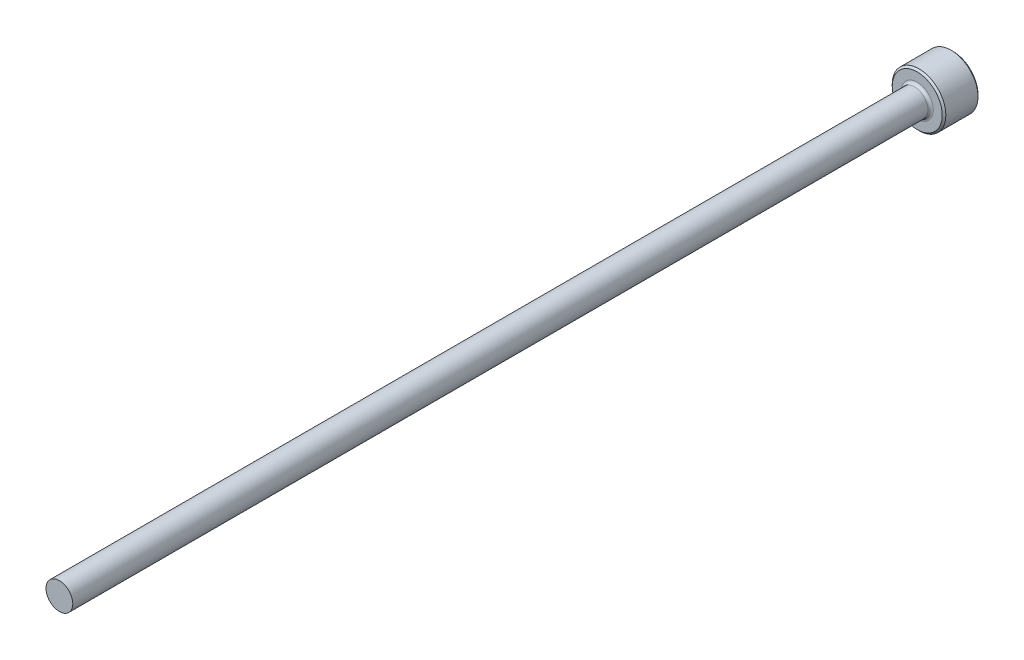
from build123d import *

# Parameters (mm, degrees)
CHAMFER1_SIZE = 0.2


with BuildPart() as part:
    # Sketch1 → Revolve1 (revolve)
    with BuildSketch(Plane(origin=(0, 0, 0), x_dir=(0, 0, -1), z_dir=(1, 0, 0)), mode=Mode.PRIVATE) as revolve1_sk:
        with BuildLine():
            Line((0, 0), (0, 3))
            Line((0, 3), (-4, 3))
            Line((-4, 3), (-4, 1.8))
            ThreePointArc((-4, 1.8), (-4.087867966, 1.587867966), (-4.3, 1.5))
            Line((-4.3, 1.5), (-100, 1.5))
            Line((-100, 1.5), (-100, 0))
            Line((-100, 0), (0, 0))
        make_face()
    revolve(revolve1_sk.sketch.rotate(Axis((0, 0, 109.05062828), (0, 0, -1)), 90), axis=Axis((0, 0, 109.05062828), (0, 0, -1)))

    # Chamfer1
    chamfer1_edges = [part.edges().sort_by_distance(p)[0] for p in [
        (-3, 0, 0),
        (-3, 0, 4),
    ]]
    chamfer(chamfer1_edges, length=CHAMFER1_SIZE)


solid = part.part
